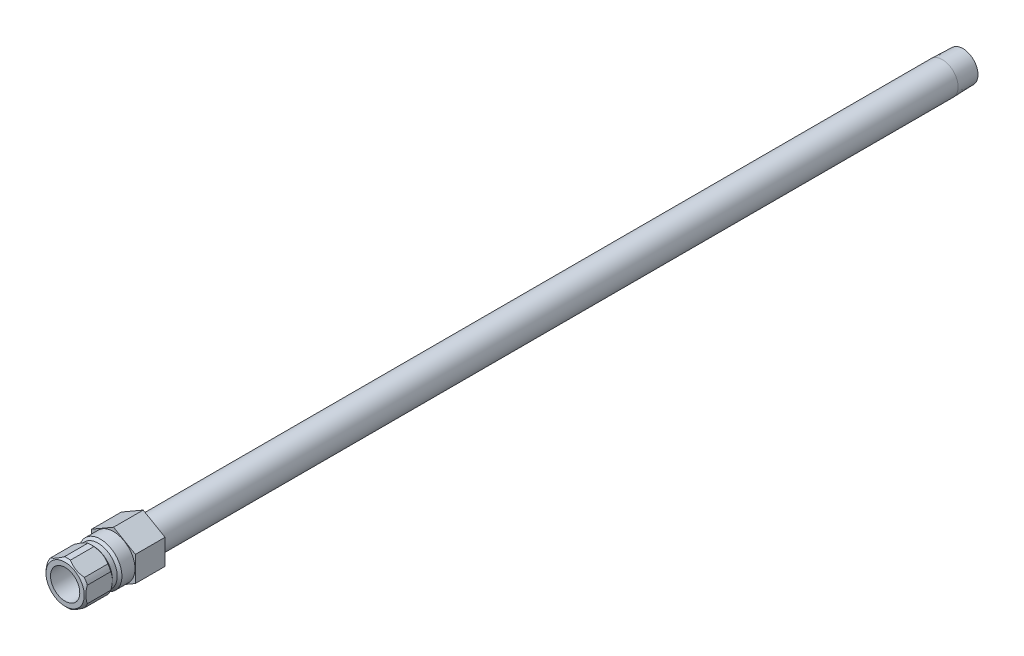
from build123d import *

# Parameters (mm, degrees)
SKETCH2_R           = 4.7625
BOSS_EXTRUDE1_DEPTH = 9.652
CUT_EXTRUDE1_START  = 6.604
SKETCH3_OUTSIDE_W   = 74.806
SKETCH3_OUTSIDE_H   = 77.006
CUT_EXTRUDE1_DEPTH  = 270.96145188


with BuildPart() as part:
    # Sketch1 → Revolve1 (revolve)
    with BuildSketch(Plane(origin=(0, 0, 0), x_dir=(0, 0, -1), z_dir=(1, 0, 0))):
        Polygon((-15.748, 4.7625), (-15.748, 6.223), (-14.986, 6.985), (-7.366, 6.985), (-6.604, 6.223), (-5.0165, 6.223), (-4.2545, 6.985), (9.652, 6.985), (9.652, 5.1435), (269.6718, 5.1435), (276.352, 4.934744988), (276.352, 3.4163), (-2.840212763, 3.4163), (-3.556, 4.7625), align=None)
    revolve(axis=Axis((0, 0, -9.652), (0, 0, 1)))

    # Sketch2 → Boss-Extrude1 (add)
    with BuildSketch(Plane.XY):
        Polygon((-7.112, 4.106115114), (-7.112, -4.106115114), (0, -8.212230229), (7.112, -4.106115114), (7.112, 4.106115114), (0, 8.212230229), align=None)
        with Locations(Location((0, 0, 0), (0, 0, 90))):
            Circle(SKETCH2_R, mode=Mode.SUBTRACT)
    extrude(amount=-BOSS_EXTRUDE1_DEPTH)

    # Sketch3 outside → Cut-Extrude1 (cut, through all)
    with BuildSketch(Plane.XY.offset(CUT_EXTRUDE1_START)):
        Rectangle(SKETCH3_OUTSIDE_W, SKETCH3_OUTSIDE_H)
        Polygon((6.477, 3.739497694), (0, 7.478995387), (-6.477, 3.739497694), (-6.477, -3.739497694), (0, -7.478995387), (6.477, -3.739497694), align=None, mode=Mode.SUBTRACT)
    extrude(amount=CUT_EXTRUDE1_DEPTH, mode=Mode.SUBTRACT)


solid = part.part
